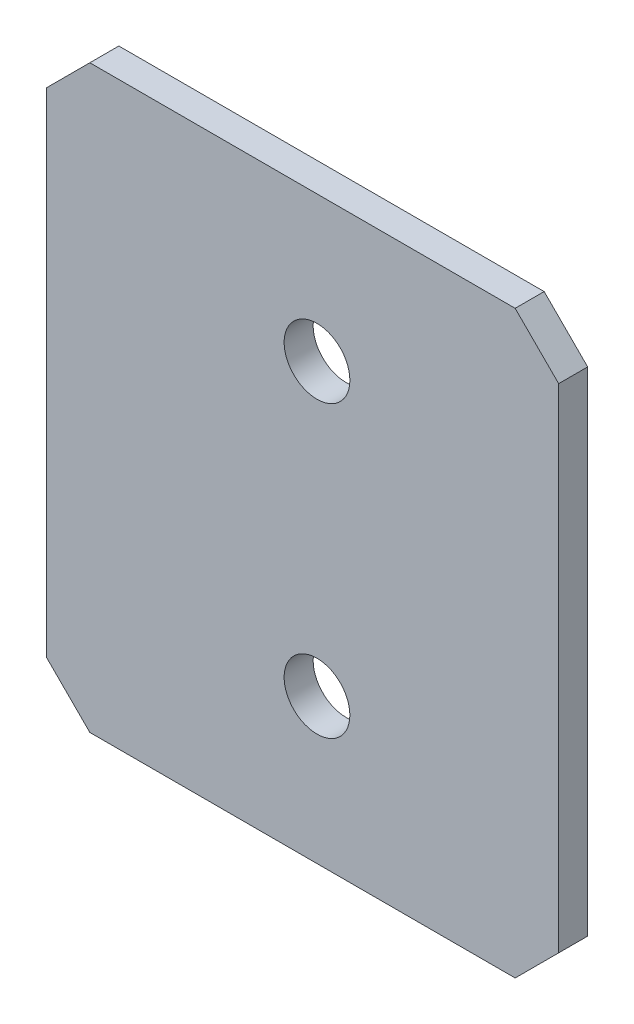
from build123d import *

# Parameters (mm, degrees)
ESQUISSE1_W           = 53
ESQUISSE1_H           = 60
EXTRUSION1_DEPTH      = 3
TROU_TARAUD_M81_D     = 6.8
TROU_TARAUD_M81_DEPTH = 19.75
TROU_TARAUD_M81_TIP   = 2.042926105
CHANFREIN1_SIZE       = 4.5


with BuildPart() as part:
    # Esquisse1 → Extrusion1 (new body)
    with BuildSketch(Plane.XY):
        with Locations((26.5, 30)):
            Rectangle(ESQUISSE1_W, ESQUISSE1_H)
    extrude(amount=EXTRUSION1_DEPTH)

    # Trou taraud_ M81
    with Locations(Plane(origin=(28, 45, 3), x_dir=(1, 0, 0), z_dir=(0, 0, 1))):
        with Locations((0, 0), (0, -30)):
            Hole(TROU_TARAUD_M81_D / 2, depth=TROU_TARAUD_M81_DEPTH)
            with Locations((0, 0, -(TROU_TARAUD_M81_DEPTH + TROU_TARAUD_M81_TIP / 2))):  # 118° drill point
                Cone(0, TROU_TARAUD_M81_D / 2, TROU_TARAUD_M81_TIP, mode=Mode.SUBTRACT)

    # Chanfrein1
    chanfrein1_edges = [part.edges().sort_by_distance(p)[0] for p in [
        (0, 60, 1.5),
        (53, 60, 1.5),
        (53, 0, 1.5),
        (0, 0, 1.5),
    ]]
    chamfer(chanfrein1_edges, length=CHANFREIN1_SIZE)


solid = part.part
